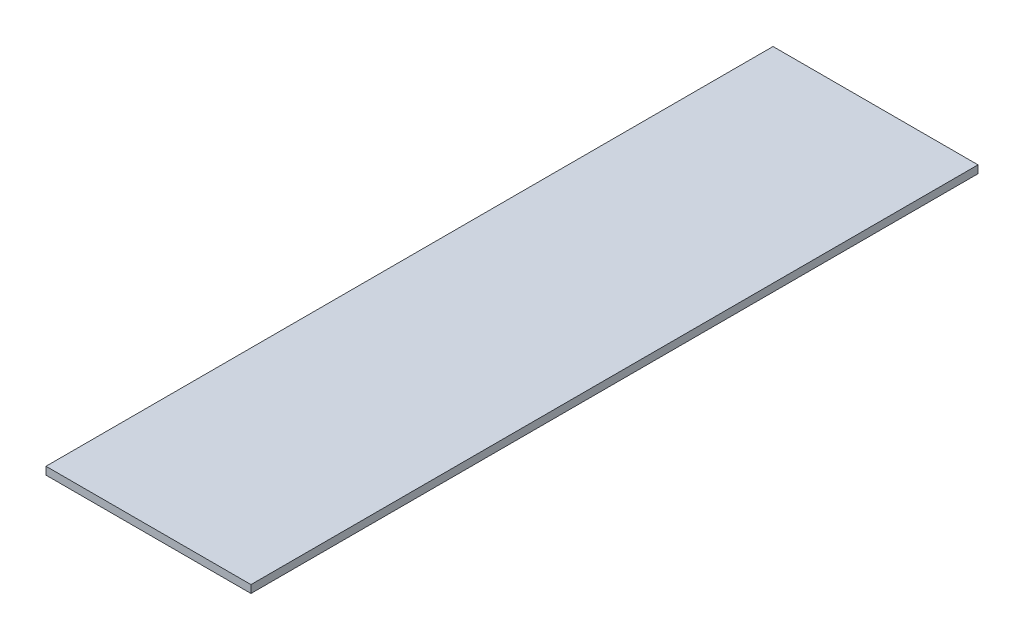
from build123d import *

# Parameters (mm, degrees)
SKETCH1_W           = 530
SKETCH1_H           = 20
BOSS_EXTRUDE1_DEPTH = 940


with BuildPart() as part:
    # Sketch1 → Boss-Extrude1 (new, symmetric)
    with BuildSketch(Plane.XY):
        Rectangle(SKETCH1_W, SKETCH1_H)
    extrude(amount=BOSS_EXTRUDE1_DEPTH, both=True)


solid = part.part
